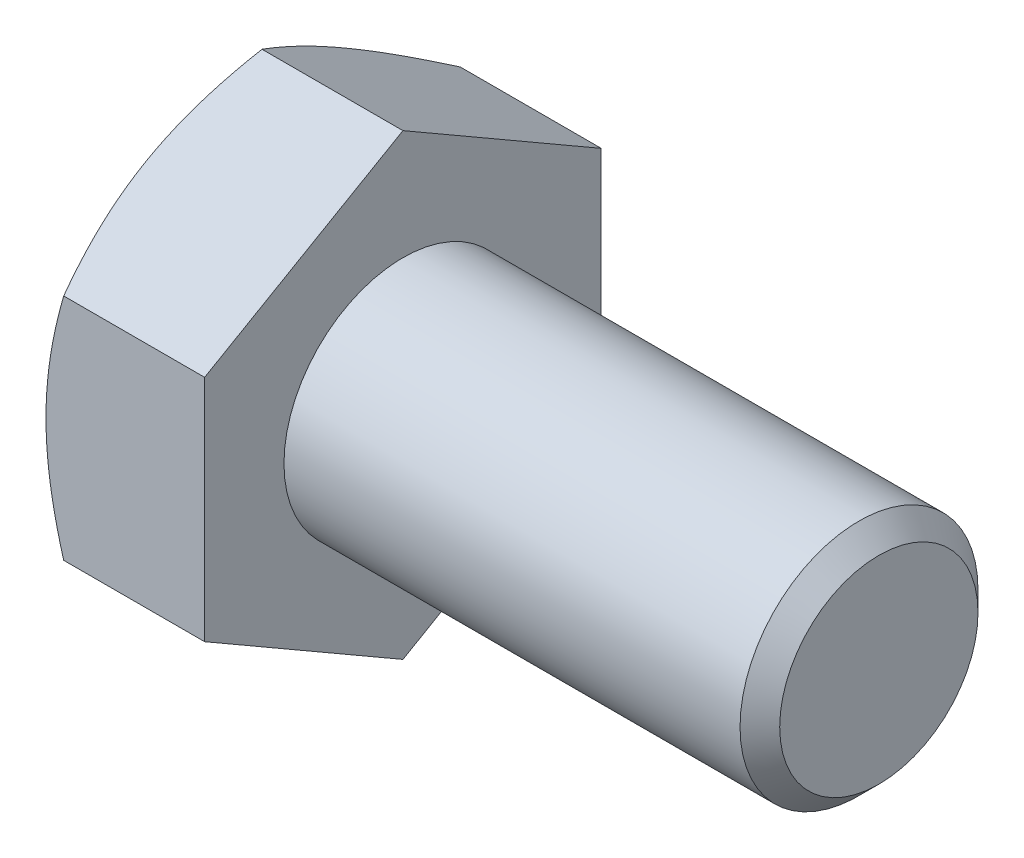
ISO-10303-21;
HEADER;
FILE_DESCRIPTION(('STEP AP214'),'2;1');
FILE_NAME('part.step','',(''),(''),'','','');
FILE_SCHEMA(('AUTOMOTIVE_DESIGN { 1 0 10303 214 1 1 1 1 }'));
ENDSEC;
DATA;
#1=APPLICATION_CONTEXT('core data for automotive mechanical design processes');
#2=APPLICATION_PROTOCOL_DEFINITION('international standard','automotive_design',2000,#1);
#3=PRODUCT_CONTEXT('',#1,'mechanical');
#4=PRODUCT('Part','Part','',(#3));
#5=PRODUCT_RELATED_PRODUCT_CATEGORY('part','',(#4));
#6=PRODUCT_DEFINITION_FORMATION('','',#4);
#7=PRODUCT_DEFINITION_CONTEXT('part definition',#1,'design');
#8=PRODUCT_DEFINITION('design','',#6,#7);
#9=PRODUCT_DEFINITION_SHAPE('','',#8);
#10=(LENGTH_UNIT() NAMED_UNIT(*) SI_UNIT(.MILLI.,.METRE.));
#11=(NAMED_UNIT(*) PLANE_ANGLE_UNIT() SI_UNIT($,.RADIAN.));
#12=(NAMED_UNIT(*) SI_UNIT($,.STERADIAN.) SOLID_ANGLE_UNIT());
#13=UNCERTAINTY_MEASURE_WITH_UNIT(LENGTH_MEASURE(1.E-05),#10,'distance_accuracy_value','');
#14=(GEOMETRIC_REPRESENTATION_CONTEXT(3) GLOBAL_UNCERTAINTY_ASSIGNED_CONTEXT((#13)) GLOBAL_UNIT_ASSIGNED_CONTEXT((#10,
#11,#12)) REPRESENTATION_CONTEXT('',''));
#15=CARTESIAN_POINT('',(0.,0.,0.));
#16=DIRECTION('',(0.,0.,1.));
#17=DIRECTION('',(1.,0.,0.));
#18=AXIS2_PLACEMENT_3D('',#15,#16,#17);
#19=CARTESIAN_POINT('',(12.,0.,0.));
#20=DIRECTION('',(-1.,0.,0.));
#21=DIRECTION('',(0.,0.,1.));
#22=AXIS2_PLACEMENT_3D('',#19,#20,#21);
#23=CYLINDRICAL_SURFACE('',#22,3.);
#24=CARTESIAN_POINT('',(11.5,0.,0.));
#25=DIRECTION('',(1.,0.,0.));
#26=DIRECTION('',(0.,0.,-1.));
#27=AXIS2_PLACEMENT_3D('',#24,#25,#26);
#28=CIRCLE('',#27,3.);
#29=CARTESIAN_POINT('',(11.5,0.,-3.));
#30=VERTEX_POINT('',#29);
#31=EDGE_CURVE('E11',#30,#30,#28,.F.);
#32=ORIENTED_EDGE('',*,*,#31,.T.);
#33=EDGE_LOOP('',(#32));
#34=FACE_BOUND('',#33,.T.);
#35=CARTESIAN_POINT('',(0.,0.,0.));
#36=DIRECTION('',(-1.,0.,0.));
#37=DIRECTION('',(0.,0.,1.));
#38=AXIS2_PLACEMENT_3D('',#35,#36,#37);
#39=CIRCLE('',#38,3.);
#40=CARTESIAN_POINT('',(0.,0.,3.));
#41=VERTEX_POINT('',#40);
#42=EDGE_CURVE('E206',#41,#41,#39,.T.);
#43=ORIENTED_EDGE('',*,*,#42,.F.);
#44=EDGE_LOOP('',(#43));
#45=FACE_BOUND('',#44,.T.);
#46=ADVANCED_FACE('F32',(#34,#45),#23,.T.);
#47=CARTESIAN_POINT('',(12.,0.,0.));
#48=DIRECTION('',(1.,0.,0.));
#49=DIRECTION('',(0.,0.,-1.));
#50=AXIS2_PLACEMENT_3D('',#47,#48,#49);
#51=PLANE('',#50);
#52=CARTESIAN_POINT('',(12.,0.,0.));
#53=DIRECTION('',(1.,0.,0.));
#54=DIRECTION('',(0.,0.,-1.));
#55=AXIS2_PLACEMENT_3D('',#52,#53,#54);
#56=CIRCLE('',#55,2.49999999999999);
#57=CARTESIAN_POINT('',(12.,0.,-2.49999999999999));
#58=VERTEX_POINT('',#57);
#59=EDGE_CURVE('E39',#58,#58,#56,.T.);
#60=ORIENTED_EDGE('',*,*,#59,.T.);
#61=EDGE_LOOP('',(#60));
#62=FACE_BOUND('',#61,.T.);
#63=ADVANCED_FACE('F192',(#62),#51,.T.);
#64=CARTESIAN_POINT('',(0.,-2.88675134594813,5.));
#65=DIRECTION('',(-1.,0.,0.));
#66=DIRECTION('',(0.,0.,1.));
#67=AXIS2_PLACEMENT_3D('',#64,#65,#66);
#68=PLANE('',#67);
#69=DIRECTION('',(0.,0.5,0.866025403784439));
#70=VECTOR('',#69,1.);
#71=CARTESIAN_POINT('',(0.,-5.77350269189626,0.));
#72=LINE('',#71,#70);
#73=CARTESIAN_POINT('',(0.,-5.77350269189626,0.));
#74=VERTEX_POINT('',#73);
#75=CARTESIAN_POINT('',(0.,-2.88675134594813,5.));
#76=VERTEX_POINT('',#75);
#77=EDGE_CURVE('E233',#74,#76,#72,.T.);
#78=ORIENTED_EDGE('',*,*,#77,.F.);
#79=DIRECTION('',(0.,0.5,-0.866025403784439));
#80=VECTOR('',#79,1.);
#81=CARTESIAN_POINT('',(0.,-5.77350269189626,0.));
#82=LINE('',#81,#80);
#83=CARTESIAN_POINT('',(0.,-2.88675134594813,-5.));
#84=VERTEX_POINT('',#83);
#85=EDGE_CURVE('E220',#74,#84,#82,.T.);
#86=ORIENTED_EDGE('',*,*,#85,.T.);
#87=DIRECTION('',(0.,1.,0.));
#88=VECTOR('',#87,1.);
#89=CARTESIAN_POINT('',(0.,-2.88675134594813,-5.));
#90=LINE('',#89,#88);
#91=CARTESIAN_POINT('',(0.,2.88675134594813,-5.));
#92=VERTEX_POINT('',#91);
#93=EDGE_CURVE('E223',#84,#92,#90,.T.);
#94=ORIENTED_EDGE('',*,*,#93,.T.);
#95=DIRECTION('',(0.,0.5,0.866025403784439));
#96=VECTOR('',#95,1.);
#97=CARTESIAN_POINT('',(0.,2.88675134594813,-5.));
#98=LINE('',#97,#96);
#99=CARTESIAN_POINT('',(0.,5.77350269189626,0.));
#100=VERTEX_POINT('',#99);
#101=EDGE_CURVE('E226',#92,#100,#98,.T.);
#102=ORIENTED_EDGE('',*,*,#101,.T.);
#103=DIRECTION('',(0.,0.5,-0.866025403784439));
#104=VECTOR('',#103,1.);
#105=CARTESIAN_POINT('',(0.,2.88675134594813,5.));
#106=LINE('',#105,#104);
#107=CARTESIAN_POINT('',(0.,2.88675134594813,5.));
#108=VERTEX_POINT('',#107);
#109=EDGE_CURVE('E229',#108,#100,#106,.T.);
#110=ORIENTED_EDGE('',*,*,#109,.F.);
#111=DIRECTION('',(0.,1.,0.));
#112=VECTOR('',#111,1.);
#113=CARTESIAN_POINT('',(0.,-2.88675134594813,5.));
#114=LINE('',#113,#112);
#115=EDGE_CURVE('E231',#76,#108,#114,.T.);
#116=ORIENTED_EDGE('',*,*,#115,.F.);
#117=EDGE_LOOP('',(#78,#86,#94,#102,#110,#116));
#118=FACE_BOUND('',#117,.T.);
#119=ORIENTED_EDGE('',*,*,#42,.T.);
#120=EDGE_LOOP('',(#119));
#121=FACE_BOUND('',#120,.T.);
#122=ADVANCED_FACE('F163',(#118,#121),#68,.F.);
#123=CARTESIAN_POINT('',(-4.,-5.77350269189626,0.));
#124=DIRECTION('',(0.,0.866025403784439,-0.5));
#125=DIRECTION('',(0.,0.5,0.866025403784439));
#126=AXIS2_PLACEMENT_3D('',#123,#124,#125);
#127=PLANE('',#126);
#128=CARTESIAN_POINT('',(-3.55335134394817,-5.7736181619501,-0.000200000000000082));
#129=CARTESIAN_POINT('',(-3.62661343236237,-5.64675433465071,0.219534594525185));
#130=CARTESIAN_POINT('',(-3.69324867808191,-5.5188054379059,0.44114858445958));
#131=CARTESIAN_POINT('',(-3.80956100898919,-5.26069210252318,0.888213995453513));
#132=CARTESIAN_POINT('',(-3.85919695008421,-5.13052307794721,1.11367335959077));
#133=CARTESIAN_POINT('',(-3.9364489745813,-4.87177839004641,1.56183230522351));
#134=CARTESIAN_POINT('',(-3.96457962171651,-4.74324302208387,1.78446209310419));
#135=CARTESIAN_POINT('',(-3.98980507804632,-4.54998783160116,2.11918990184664));
#136=CARTESIAN_POINT('',(-3.99538654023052,-4.48552534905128,2.23084219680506));
#137=CARTESIAN_POINT('',(-4.00079778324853,-4.35654081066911,2.4542499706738));
#138=CARTESIAN_POINT('',(-4.0006277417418,-4.2920187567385,2.56600544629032));
#139=CARTESIAN_POINT('',(-3.99224636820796,-4.11524635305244,2.87218423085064));
#140=CARTESIAN_POINT('',(-3.97817022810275,-4.00305457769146,3.06650608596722));
#141=CARTESIAN_POINT('',(-3.93353474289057,-3.77941563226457,3.45386010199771));
#142=CARTESIAN_POINT('',(-3.90296013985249,-3.66796924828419,3.64689090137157));
#143=CARTESIAN_POINT('',(-3.82653150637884,-3.44387972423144,4.03502534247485));
#144=CARTESIAN_POINT('',(-3.78035362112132,-3.3312648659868,4.23007999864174));
#145=CARTESIAN_POINT('',(-3.67554820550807,-3.10771464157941,4.61728034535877));
#146=CARTESIAN_POINT('',(-3.61694529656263,-2.99677641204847,4.80943099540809));
#147=CARTESIAN_POINT('',(-3.55335134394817,-2.88663587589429,5.0002));
#148=B_SPLINE_CURVE_WITH_KNOTS('',3,(#128,#129,#130,#131,#132,#133,#134,#135,#136,#137,#138,
#139,#140,#141,#142,#143,#144,#145,#146,#147),.UNSPECIFIED.,.F.,.F.,(4,2,2,2,2,2,2,2,2,4),(0.,
0.79255584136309,1.58701660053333,2.36181537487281,2.74884076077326,3.13585419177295,
3.80962362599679,4.48401723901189,5.17336882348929,5.86136694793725),.UNSPECIFIED.);
#149=CARTESIAN_POINT('',(-3.5534180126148,-5.77350269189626,0.));
#150=VERTEX_POINT('',#149);
#151=CARTESIAN_POINT('',(-4.,-4.3301270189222,2.5));
#152=VERTEX_POINT('',#151);
#153=EDGE_CURVE('E180',#150,#152,#148,.T.);
#154=ORIENTED_EDGE('',*,*,#153,.F.);
#155=DIRECTION('',(1.,0.,0.));
#156=VECTOR('',#155,1.);
#157=CARTESIAN_POINT('',(-4.,-5.77350269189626,0.));
#158=LINE('',#157,#156);
#159=EDGE_CURVE('E218',#150,#74,#158,.T.);
#160=ORIENTED_EDGE('',*,*,#159,.T.);
#161=ORIENTED_EDGE('',*,*,#77,.T.);
#162=DIRECTION('',(1.,0.,0.));
#163=VECTOR('',#162,1.);
#164=CARTESIAN_POINT('',(-4.,-2.88675134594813,5.));
#165=LINE('',#164,#163);
#166=CARTESIAN_POINT('',(-3.5534180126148,-2.88675134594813,5.));
#167=VERTEX_POINT('',#166);
#168=EDGE_CURVE('E209',#167,#76,#165,.T.);
#169=ORIENTED_EDGE('',*,*,#168,.F.);
#170=EDGE_CURVE('E134',#152,#167,#148,.T.);
#171=ORIENTED_EDGE('',*,*,#170,.F.);
#172=EDGE_LOOP('',(#154,#160,#161,#169,#171));
#173=FACE_BOUND('',#172,.T.);
#174=ADVANCED_FACE('F186',(#173),#127,.F.);
#175=CARTESIAN_POINT('',(-4.,-2.88675134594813,5.));
#176=DIRECTION('',(0.,0.,-1.));
#177=DIRECTION('',(-1.,0.,0.));
#178=AXIS2_PLACEMENT_3D('',#175,#176,#177);
#179=PLANE('',#178);
#180=CARTESIAN_POINT('',(-1.50175754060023,-7.8736570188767,5.));
#181=CARTESIAN_POINT('',(-1.6086809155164,-7.65421637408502,5.));
#182=CARTESIAN_POINT('',(-1.71461296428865,-7.43428458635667,5.));
#183=CARTESIAN_POINT('',(-1.92393906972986,-6.99317792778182,5.));
#184=CARTESIAN_POINT('',(-2.02733274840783,-6.77200287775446,5.));
#185=CARTESIAN_POINT('',(-2.23152152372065,-6.32706593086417,5.));
#186=CARTESIAN_POINT('',(-2.33230041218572,-6.10329657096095,5.));
#187=CARTESIAN_POINT('',(-2.52988978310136,-5.65401907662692,5.));
#188=CARTESIAN_POINT('',(-2.62670044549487,-5.42851102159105,5.));
#189=CARTESIAN_POINT('',(-2.81850105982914,-4.96773019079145,5.));
#190=CARTESIAN_POINT('',(-2.91331851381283,-4.73238523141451,5.));
#191=CARTESIAN_POINT('',(-3.09606229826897,-4.25898650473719,5.));
#192=CARTESIAN_POINT('',(-3.18398787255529,-4.02093244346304,5.));
#193=CARTESIAN_POINT('',(-3.35072723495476,-3.54214478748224,5.));
#194=CARTESIAN_POINT('',(-3.42955846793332,-3.30141732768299,5.));
#195=CARTESIAN_POINT('',(-3.57565910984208,-2.81651125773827,5.));
#196=CARTESIAN_POINT('',(-3.64293203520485,-2.5723337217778,5.));
#197=CARTESIAN_POINT('',(-3.7624103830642,-2.08173956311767,5.));
#198=CARTESIAN_POINT('',(-3.81470009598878,-1.83534384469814,5.));
#199=CARTESIAN_POINT('',(-3.90133365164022,-1.33936717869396,5.));
#200=CARTESIAN_POINT('',(-3.93567944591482,-1.08978658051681,5.));
#201=CARTESIAN_POINT('',(-3.98324171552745,-0.59199465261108,5.));
#202=CARTESIAN_POINT('',(-3.99673913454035,-0.343810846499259,5.));
#203=CARTESIAN_POINT('',(-4.00220795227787,0.152820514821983,5.));
#204=CARTESIAN_POINT('',(-3.99417903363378,0.401268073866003,5.));
#205=CARTESIAN_POINT('',(-3.96311999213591,0.819539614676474,5.));
#206=CARTESIAN_POINT('',(-3.94552930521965,0.989794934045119,5.));
#207=CARTESIAN_POINT('',(-3.90127081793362,1.32912938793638,5.));
#208=CARTESIAN_POINT('',(-3.87460188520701,1.4982083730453,5.));
#209=CARTESIAN_POINT('',(-3.78237229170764,2.00341173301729,5.));
#210=CARTESIAN_POINT('',(-3.7046029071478,2.337335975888,5.));
#211=CARTESIAN_POINT('',(-3.56883106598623,2.83691487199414,5.));
#212=CARTESIAN_POINT('',(-3.51971360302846,3.00513229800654,5.));
#213=CARTESIAN_POINT('',(-3.41615110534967,3.33993504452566,5.));
#214=CARTESIAN_POINT('',(-3.36170602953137,3.5065203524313,5.));
#215=CARTESIAN_POINT('',(-3.24838071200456,3.83810926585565,5.));
#216=CARTESIAN_POINT('',(-3.18950171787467,4.00311330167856,5.));
#217=CARTESIAN_POINT('',(-3.0680238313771,4.33173746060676,5.));
#218=CARTESIAN_POINT('',(-3.00542502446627,4.49535761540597,5.));
#219=CARTESIAN_POINT('',(-2.83201950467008,4.93598294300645,5.));
#220=CARTESIAN_POINT('',(-2.71826266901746,5.21182602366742,5.));
#221=CARTESIAN_POINT('',(-2.48405585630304,5.76066658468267,5.));
#222=CARTESIAN_POINT('',(-2.36360513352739,6.03366374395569,5.));
#223=CARTESIAN_POINT('',(-2.11759609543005,6.57746623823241,5.));
#224=CARTESIAN_POINT('',(-1.99203582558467,6.84827068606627,5.));
#225=CARTESIAN_POINT('',(-1.73703058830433,7.38802449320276,5.));
#226=CARTESIAN_POINT('',(-1.60758577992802,7.65697392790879,5.));
#227=CARTESIAN_POINT('',(-1.34544789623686,8.19381940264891,5.));
#228=CARTESIAN_POINT('',(-1.21274991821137,8.46171304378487,5.));
#229=CARTESIAN_POINT('',(-0.944933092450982,8.99628800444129,5.));
#230=CARTESIAN_POINT('',(-0.809814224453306,9.26296931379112,5.));
#231=CARTESIAN_POINT('',(-0.401627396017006,10.0614145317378,5.));
#232=CARTESIAN_POINT('',(-0.125669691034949,10.5917004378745,5.));
#233=CARTESIAN_POINT('',(0.401869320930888,11.5934978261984,5.));
#234=CARTESIAN_POINT('',(0.652934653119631,12.0652823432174,5.));
#235=CARTESIAN_POINT('',(1.15809174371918,13.0072652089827,5.));
#236=CARTESIAN_POINT('',(1.41218368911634,13.4774634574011,5.));
#237=CARTESIAN_POINT('',(1.92174727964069,14.4150598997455,5.));
#238=CARTESIAN_POINT('',(2.17721139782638,14.8824621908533,5.));
#239=CARTESIAN_POINT('',(2.68985606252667,15.8162766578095,5.));
#240=CARTESIAN_POINT('',(2.94703647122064,16.2826889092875,5.));
#241=CARTESIAN_POINT('',(3.20484156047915,16.7487534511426,5.));
#242=B_SPLINE_CURVE_WITH_KNOTS('',3,(#180,#181,#182,#183,#184,#185,#186,#187,#188,#189,#190,
#191,#192,#193,#194,#195,#196,#197,#198,#199,#200,#201,#202,#203,#204,#205,#206,#207,#208,#209,
#210,#211,#212,#213,#214,#215,#216,#217,#218,#219,#220,#221,#222,#223,#224,#225,#226,#227,#228,
#229,#230,#231,#232,#233,#234,#235,#236,#237,#238,#239,#240,#241),.UNSPECIFIED.,.F.,.F.,(4,2,2,
2,2,2,2,2,2,2,2,2,2,2,2,2,2,2,2,2,2,2,2,2,2,2,2,2,2,2,4),(0.,0.732320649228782,1.46474969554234,
2.20096737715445,2.93715163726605,3.69825037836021,4.45943251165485,5.21912936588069,
5.97859468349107,6.73369963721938,7.48872245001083,8.23347928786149,8.97824710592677,
9.49148539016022,10.0047877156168,11.0318914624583,11.5575684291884,12.0832494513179,
12.6087831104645,13.1343047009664,14.0293094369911,14.9244140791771,15.819864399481,
16.7152781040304,17.612136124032,18.5090016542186,20.3023290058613,21.9056050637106,
23.5089806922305,25.106957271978,26.7048070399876),.UNSPECIFIED.);
#243=CARTESIAN_POINT('',(-4.,0.,5.));
#244=VERTEX_POINT('',#243);
#245=EDGE_CURVE('E235',#167,#244,#242,.T.);
#246=ORIENTED_EDGE('',*,*,#245,.F.);
#247=ORIENTED_EDGE('',*,*,#168,.T.);
#248=ORIENTED_EDGE('',*,*,#115,.T.);
#249=DIRECTION('',(1.,0.,0.));
#250=VECTOR('',#249,1.);
#251=CARTESIAN_POINT('',(-4.,2.88675134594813,5.));
#252=LINE('',#251,#250);
#253=CARTESIAN_POINT('',(-3.5534180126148,2.88675134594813,5.));
#254=VERTEX_POINT('',#253);
#255=EDGE_CURVE('E211',#254,#108,#252,.T.);
#256=ORIENTED_EDGE('',*,*,#255,.F.);
#257=EDGE_CURVE('E105',#244,#254,#242,.T.);
#258=ORIENTED_EDGE('',*,*,#257,.F.);
#259=EDGE_LOOP('',(#246,#247,#248,#256,#258));
#260=FACE_BOUND('',#259,.T.);
#261=ADVANCED_FACE('F189',(#260),#179,.F.);
#262=CARTESIAN_POINT('',(-4.,2.88675134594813,5.));
#263=DIRECTION('',(0.,-0.866025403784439,-0.5));
#264=DIRECTION('',(0.,0.5,-0.866025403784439));
#265=AXIS2_PLACEMENT_3D('',#262,#263,#264);
#266=PLANE('',#265);
#267=CARTESIAN_POINT('',(-3.55335134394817,2.88663587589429,5.0002));
#268=CARTESIAN_POINT('',(-3.62661343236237,3.01349970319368,4.78046540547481));
#269=CARTESIAN_POINT('',(-3.69324867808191,3.14144859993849,4.55885141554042));
#270=CARTESIAN_POINT('',(-3.80956100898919,3.39956193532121,4.11178600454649));
#271=CARTESIAN_POINT('',(-3.85919695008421,3.52973095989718,3.88632664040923));
#272=CARTESIAN_POINT('',(-3.9364489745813,3.78847564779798,3.43816769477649));
#273=CARTESIAN_POINT('',(-3.96457962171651,3.91701101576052,3.21553790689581));
#274=CARTESIAN_POINT('',(-3.98980507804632,4.11026620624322,2.88081009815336));
#275=CARTESIAN_POINT('',(-3.99538654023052,4.17472868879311,2.76915780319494));
#276=CARTESIAN_POINT('',(-4.00079778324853,4.30371322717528,2.5457500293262));
#277=CARTESIAN_POINT('',(-4.0006277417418,4.36823528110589,2.43399455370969));
#278=CARTESIAN_POINT('',(-3.99224636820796,4.54500768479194,2.12781576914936));
#279=CARTESIAN_POINT('',(-3.97817022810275,4.65719946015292,1.93349391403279));
#280=CARTESIAN_POINT('',(-3.93353474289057,4.88083840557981,1.54613989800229));
#281=CARTESIAN_POINT('',(-3.90296013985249,4.9922847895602,1.35310909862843));
#282=CARTESIAN_POINT('',(-3.82653150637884,5.21637431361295,0.964974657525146));
#283=CARTESIAN_POINT('',(-3.78035362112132,5.32898917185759,0.769920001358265));
#284=CARTESIAN_POINT('',(-3.67554820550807,5.55253939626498,0.382719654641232));
#285=CARTESIAN_POINT('',(-3.61694529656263,5.66347762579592,0.190569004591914));
#286=CARTESIAN_POINT('',(-3.55335134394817,5.7736181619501,-0.000199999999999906));
#287=B_SPLINE_CURVE_WITH_KNOTS('',3,(#267,#268,#269,#270,#271,#272,#273,#274,#275,#276,#277,
#278,#279,#280,#281,#282,#283,#284,#285,#286),.UNSPECIFIED.,.F.,.F.,(4,2,2,2,2,2,2,2,2,4),(0.,
0.792555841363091,1.58701660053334,2.36181537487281,2.74884076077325,3.13585419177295,
3.80962362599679,4.48401723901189,5.17336882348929,5.86136694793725),.UNSPECIFIED.);
#288=CARTESIAN_POINT('',(-4.,4.33012701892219,2.5));
#289=VERTEX_POINT('',#288);
#290=EDGE_CURVE('E101',#254,#289,#287,.T.);
#291=ORIENTED_EDGE('',*,*,#290,.F.);
#292=ORIENTED_EDGE('',*,*,#255,.T.);
#293=ORIENTED_EDGE('',*,*,#109,.T.);
#294=DIRECTION('',(1.,0.,0.));
#295=VECTOR('',#294,1.);
#296=CARTESIAN_POINT('',(-4.,5.77350269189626,0.));
#297=LINE('',#296,#295);
#298=CARTESIAN_POINT('',(-3.5534180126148,5.77350269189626,0.));
#299=VERTEX_POINT('',#298);
#300=EDGE_CURVE('E133',#299,#100,#297,.T.);
#301=ORIENTED_EDGE('',*,*,#300,.F.);
#302=EDGE_CURVE('E109',#289,#299,#287,.T.);
#303=ORIENTED_EDGE('',*,*,#302,.F.);
#304=EDGE_LOOP('',(#291,#292,#293,#301,#303));
#305=FACE_BOUND('',#304,.T.);
#306=ADVANCED_FACE('F131',(#305),#266,.F.);
#307=CARTESIAN_POINT('',(-4.,2.88675134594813,-5.));
#308=DIRECTION('',(0.,0.866025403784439,-0.5));
#309=DIRECTION('',(0.,0.5,0.866025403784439));
#310=AXIS2_PLACEMENT_3D('',#307,#308,#309);
#311=PLANE('',#310);
#312=DIRECTION('',(1.,0.,0.));
#313=VECTOR('',#312,1.);
#314=CARTESIAN_POINT('',(-4.,2.88675134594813,-5.));
#315=LINE('',#314,#313);
#316=CARTESIAN_POINT('',(-3.5534180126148,2.88675134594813,-5.));
#317=VERTEX_POINT('',#316);
#318=EDGE_CURVE('E214',#317,#92,#315,.T.);
#319=ORIENTED_EDGE('',*,*,#318,.F.);
#320=CARTESIAN_POINT('',(-3.55335134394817,2.88663587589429,-5.0002));
#321=CARTESIAN_POINT('',(-3.62661343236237,3.01349970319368,-4.78046540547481));
#322=CARTESIAN_POINT('',(-3.69324867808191,3.14144859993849,-4.55885141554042));
#323=CARTESIAN_POINT('',(-3.80956100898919,3.39956193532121,-4.11178600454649));
#324=CARTESIAN_POINT('',(-3.85919695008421,3.52973095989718,-3.88632664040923));
#325=CARTESIAN_POINT('',(-3.9364489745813,3.78847564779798,-3.43816769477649));
#326=CARTESIAN_POINT('',(-3.96457962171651,3.91701101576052,-3.21553790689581));
#327=CARTESIAN_POINT('',(-3.98980507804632,4.11026620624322,-2.88081009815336));
#328=CARTESIAN_POINT('',(-3.99538654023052,4.17472868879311,-2.76915780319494));
#329=CARTESIAN_POINT('',(-4.00079778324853,4.30371322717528,-2.5457500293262));
#330=CARTESIAN_POINT('',(-4.0006277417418,4.36823528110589,-2.43399455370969));
#331=CARTESIAN_POINT('',(-3.99224636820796,4.54500768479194,-2.12781576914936));
#332=CARTESIAN_POINT('',(-3.97817022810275,4.65719946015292,-1.93349391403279));
#333=CARTESIAN_POINT('',(-3.93353474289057,4.88083840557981,-1.54613989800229));
#334=CARTESIAN_POINT('',(-3.90296013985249,4.9922847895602,-1.35310909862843));
#335=CARTESIAN_POINT('',(-3.82653150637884,5.21637431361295,-0.964974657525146));
#336=CARTESIAN_POINT('',(-3.78035362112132,5.32898917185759,-0.769920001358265));
#337=CARTESIAN_POINT('',(-3.67554820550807,5.55253939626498,-0.382719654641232));
#338=CARTESIAN_POINT('',(-3.61694529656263,5.66347762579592,-0.190569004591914));
#339=CARTESIAN_POINT('',(-3.55335134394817,5.7736181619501,0.000199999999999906));
#340=B_SPLINE_CURVE_WITH_KNOTS('',3,(#320,#321,#322,#323,#324,#325,#326,#327,#328,#329,#330,
#331,#332,#333,#334,#335,#336,#337,#338,#339),.UNSPECIFIED.,.F.,.F.,(4,2,2,2,2,2,2,2,2,4),(0.,
0.792555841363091,1.58701660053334,2.36181537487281,2.74884076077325,3.13585419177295,
3.80962362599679,4.48401723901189,5.17336882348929,5.86136694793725),.UNSPECIFIED.);
#341=CARTESIAN_POINT('',(-4.,4.33012701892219,-2.5));
#342=VERTEX_POINT('',#341);
#343=EDGE_CURVE('E136',#317,#342,#340,.T.);
#344=ORIENTED_EDGE('',*,*,#343,.T.);
#345=EDGE_CURVE('E116',#342,#299,#340,.T.);
#346=ORIENTED_EDGE('',*,*,#345,.T.);
#347=ORIENTED_EDGE('',*,*,#300,.T.);
#348=ORIENTED_EDGE('',*,*,#101,.F.);
#349=EDGE_LOOP('',(#319,#344,#346,#347,#348));
#350=FACE_BOUND('',#349,.T.);
#351=ADVANCED_FACE('F261',(#350),#311,.T.);
#352=CARTESIAN_POINT('',(-4.,-2.88675134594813,-5.));
#353=DIRECTION('',(0.,0.,-1.));
#354=DIRECTION('',(-1.,0.,0.));
#355=AXIS2_PLACEMENT_3D('',#352,#353,#354);
#356=PLANE('',#355);
#357=DIRECTION('',(1.,0.,0.));
#358=VECTOR('',#357,1.);
#359=CARTESIAN_POINT('',(-4.,-2.88675134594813,-5.));
#360=LINE('',#359,#358);
#361=CARTESIAN_POINT('',(-3.5534180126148,-2.88675134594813,-5.));
#362=VERTEX_POINT('',#361);
#363=EDGE_CURVE('E216',#362,#84,#360,.T.);
#364=ORIENTED_EDGE('',*,*,#363,.F.);
#365=CARTESIAN_POINT('',(-1.50175754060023,-7.8736570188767,-5.));
#366=CARTESIAN_POINT('',(-1.6086809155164,-7.65421637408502,-5.));
#367=CARTESIAN_POINT('',(-1.71461296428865,-7.43428458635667,-5.));
#368=CARTESIAN_POINT('',(-1.92393906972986,-6.99317792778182,-5.));
#369=CARTESIAN_POINT('',(-2.02733274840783,-6.77200287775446,-5.));
#370=CARTESIAN_POINT('',(-2.23152152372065,-6.32706593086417,-5.));
#371=CARTESIAN_POINT('',(-2.33230041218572,-6.10329657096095,-5.));
#372=CARTESIAN_POINT('',(-2.52988978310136,-5.65401907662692,-5.));
#373=CARTESIAN_POINT('',(-2.62670044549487,-5.42851102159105,-5.));
#374=CARTESIAN_POINT('',(-2.81850105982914,-4.96773019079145,-5.));
#375=CARTESIAN_POINT('',(-2.91331851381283,-4.73238523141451,-5.));
#376=CARTESIAN_POINT('',(-3.09606229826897,-4.25898650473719,-5.));
#377=CARTESIAN_POINT('',(-3.18398787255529,-4.02093244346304,-5.));
#378=CARTESIAN_POINT('',(-3.35072723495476,-3.54214478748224,-5.));
#379=CARTESIAN_POINT('',(-3.42955846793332,-3.30141732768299,-5.));
#380=CARTESIAN_POINT('',(-3.57565910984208,-2.81651125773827,-5.));
#381=CARTESIAN_POINT('',(-3.64293203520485,-2.5723337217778,-5.));
#382=CARTESIAN_POINT('',(-3.7624103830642,-2.08173956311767,-5.));
#383=CARTESIAN_POINT('',(-3.81470009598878,-1.83534384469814,-5.));
#384=CARTESIAN_POINT('',(-3.90133365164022,-1.33936717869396,-5.));
#385=CARTESIAN_POINT('',(-3.93567944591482,-1.08978658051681,-5.));
#386=CARTESIAN_POINT('',(-3.98324171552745,-0.59199465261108,-5.));
#387=CARTESIAN_POINT('',(-3.99673913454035,-0.343810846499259,-5.));
#388=CARTESIAN_POINT('',(-4.00220795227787,0.152820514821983,-5.));
#389=CARTESIAN_POINT('',(-3.99417903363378,0.401268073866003,-5.));
#390=CARTESIAN_POINT('',(-3.96311999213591,0.819539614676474,-5.));
#391=CARTESIAN_POINT('',(-3.94552930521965,0.989794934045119,-5.));
#392=CARTESIAN_POINT('',(-3.90127081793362,1.32912938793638,-5.));
#393=CARTESIAN_POINT('',(-3.87460188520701,1.4982083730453,-5.));
#394=CARTESIAN_POINT('',(-3.78237229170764,2.00341173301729,-5.));
#395=CARTESIAN_POINT('',(-3.7046029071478,2.337335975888,-5.));
#396=CARTESIAN_POINT('',(-3.56883106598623,2.83691487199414,-5.));
#397=CARTESIAN_POINT('',(-3.51971360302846,3.00513229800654,-5.));
#398=CARTESIAN_POINT('',(-3.41615110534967,3.33993504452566,-5.));
#399=CARTESIAN_POINT('',(-3.36170602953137,3.5065203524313,-5.));
#400=CARTESIAN_POINT('',(-3.24838071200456,3.83810926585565,-5.));
#401=CARTESIAN_POINT('',(-3.18950171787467,4.00311330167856,-5.));
#402=CARTESIAN_POINT('',(-3.0680238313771,4.33173746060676,-5.));
#403=CARTESIAN_POINT('',(-3.00542502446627,4.49535761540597,-5.));
#404=CARTESIAN_POINT('',(-2.83201950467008,4.93598294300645,-5.));
#405=CARTESIAN_POINT('',(-2.71826266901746,5.21182602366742,-5.));
#406=CARTESIAN_POINT('',(-2.48405585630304,5.76066658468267,-5.));
#407=CARTESIAN_POINT('',(-2.36360513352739,6.03366374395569,-5.));
#408=CARTESIAN_POINT('',(-2.11759609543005,6.57746623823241,-5.));
#409=CARTESIAN_POINT('',(-1.99203582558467,6.84827068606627,-5.));
#410=CARTESIAN_POINT('',(-1.73703058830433,7.38802449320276,-5.));
#411=CARTESIAN_POINT('',(-1.60758577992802,7.65697392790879,-5.));
#412=CARTESIAN_POINT('',(-1.34544789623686,8.19381940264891,-5.));
#413=CARTESIAN_POINT('',(-1.21274991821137,8.46171304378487,-5.));
#414=CARTESIAN_POINT('',(-0.944933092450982,8.99628800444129,-5.));
#415=CARTESIAN_POINT('',(-0.809814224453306,9.26296931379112,-5.));
#416=CARTESIAN_POINT('',(-0.401627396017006,10.0614145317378,-5.));
#417=CARTESIAN_POINT('',(-0.125669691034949,10.5917004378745,-5.));
#418=CARTESIAN_POINT('',(0.401869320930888,11.5934978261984,-5.));
#419=CARTESIAN_POINT('',(0.652934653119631,12.0652823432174,-5.));
#420=CARTESIAN_POINT('',(1.15809174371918,13.0072652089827,-5.));
#421=CARTESIAN_POINT('',(1.41218368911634,13.4774634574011,-5.));
#422=CARTESIAN_POINT('',(1.92174727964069,14.4150598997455,-5.));
#423=CARTESIAN_POINT('',(2.17721139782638,14.8824621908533,-5.));
#424=CARTESIAN_POINT('',(2.68985606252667,15.8162766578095,-5.));
#425=CARTESIAN_POINT('',(2.94703647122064,16.2826889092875,-5.));
#426=CARTESIAN_POINT('',(3.20484156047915,16.7487534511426,-5.));
#427=B_SPLINE_CURVE_WITH_KNOTS('',3,(#365,#366,#367,#368,#369,#370,#371,#372,#373,#374,#375,
#376,#377,#378,#379,#380,#381,#382,#383,#384,#385,#386,#387,#388,#389,#390,#391,#392,#393,#394,
#395,#396,#397,#398,#399,#400,#401,#402,#403,#404,#405,#406,#407,#408,#409,#410,#411,#412,#413,
#414,#415,#416,#417,#418,#419,#420,#421,#422,#423,#424,#425,#426),.UNSPECIFIED.,.F.,.F.,(4,2,2,
2,2,2,2,2,2,2,2,2,2,2,2,2,2,2,2,2,2,2,2,2,2,2,2,2,2,2,4),(0.,0.732320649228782,1.46474969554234,
2.20096737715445,2.93715163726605,3.69825037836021,4.45943251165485,5.21912936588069,
5.97859468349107,6.73369963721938,7.48872245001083,8.23347928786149,8.97824710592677,
9.49148539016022,10.0047877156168,11.0318914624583,11.5575684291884,12.0832494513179,
12.6087831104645,13.1343047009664,14.0293094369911,14.9244140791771,15.819864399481,
16.7152781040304,17.612136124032,18.5090016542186,20.3023290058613,21.9056050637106,
23.5089806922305,25.106957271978,26.7048070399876),.UNSPECIFIED.);
#428=CARTESIAN_POINT('',(-4.,0.,-5.));
#429=VERTEX_POINT('',#428);
#430=EDGE_CURVE('E54',#362,#429,#427,.T.);
#431=ORIENTED_EDGE('',*,*,#430,.T.);
#432=EDGE_CURVE('E185',#429,#317,#427,.T.);
#433=ORIENTED_EDGE('',*,*,#432,.T.);
#434=ORIENTED_EDGE('',*,*,#318,.T.);
#435=ORIENTED_EDGE('',*,*,#93,.F.);
#436=EDGE_LOOP('',(#364,#431,#433,#434,#435));
#437=FACE_BOUND('',#436,.T.);
#438=ADVANCED_FACE('F257',(#437),#356,.T.);
#439=CARTESIAN_POINT('',(-4.,-5.77350269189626,0.));
#440=DIRECTION('',(0.,-0.866025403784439,-0.5));
#441=DIRECTION('',(0.,0.5,-0.866025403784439));
#442=AXIS2_PLACEMENT_3D('',#439,#440,#441);
#443=PLANE('',#442);
#444=ORIENTED_EDGE('',*,*,#159,.F.);
#445=CARTESIAN_POINT('',(-3.55335134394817,-5.7736181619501,0.000200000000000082));
#446=CARTESIAN_POINT('',(-3.62661343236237,-5.64675433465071,-0.219534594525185));
#447=CARTESIAN_POINT('',(-3.69324867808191,-5.5188054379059,-0.44114858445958));
#448=CARTESIAN_POINT('',(-3.80956100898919,-5.26069210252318,-0.888213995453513));
#449=CARTESIAN_POINT('',(-3.85919695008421,-5.13052307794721,-1.11367335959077));
#450=CARTESIAN_POINT('',(-3.9364489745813,-4.87177839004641,-1.56183230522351));
#451=CARTESIAN_POINT('',(-3.96457962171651,-4.74324302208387,-1.78446209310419));
#452=CARTESIAN_POINT('',(-3.98980507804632,-4.54998783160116,-2.11918990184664));
#453=CARTESIAN_POINT('',(-3.99538654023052,-4.48552534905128,-2.23084219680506));
#454=CARTESIAN_POINT('',(-4.00079778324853,-4.35654081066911,-2.4542499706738));
#455=CARTESIAN_POINT('',(-4.0006277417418,-4.2920187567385,-2.56600544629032));
#456=CARTESIAN_POINT('',(-3.99224636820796,-4.11524635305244,-2.87218423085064));
#457=CARTESIAN_POINT('',(-3.97817022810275,-4.00305457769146,-3.06650608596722));
#458=CARTESIAN_POINT('',(-3.93353474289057,-3.77941563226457,-3.45386010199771));
#459=CARTESIAN_POINT('',(-3.90296013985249,-3.66796924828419,-3.64689090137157));
#460=CARTESIAN_POINT('',(-3.82653150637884,-3.44387972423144,-4.03502534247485));
#461=CARTESIAN_POINT('',(-3.78035362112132,-3.3312648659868,-4.23007999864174));
#462=CARTESIAN_POINT('',(-3.67554820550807,-3.10771464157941,-4.61728034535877));
#463=CARTESIAN_POINT('',(-3.61694529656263,-2.99677641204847,-4.80943099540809));
#464=CARTESIAN_POINT('',(-3.55335134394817,-2.88663587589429,-5.0002));
#465=B_SPLINE_CURVE_WITH_KNOTS('',3,(#445,#446,#447,#448,#449,#450,#451,#452,#453,#454,#455,
#456,#457,#458,#459,#460,#461,#462,#463,#464),.UNSPECIFIED.,.F.,.F.,(4,2,2,2,2,2,2,2,2,4),(0.,
0.79255584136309,1.58701660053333,2.36181537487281,2.74884076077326,3.13585419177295,
3.80962362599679,4.48401723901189,5.17336882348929,5.86136694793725),.UNSPECIFIED.);
#466=CARTESIAN_POINT('',(-4.,-4.3301270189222,-2.5));
#467=VERTEX_POINT('',#466);
#468=EDGE_CURVE('E249',#150,#467,#465,.T.);
#469=ORIENTED_EDGE('',*,*,#468,.T.);
#470=EDGE_CURVE('E128',#467,#362,#465,.T.);
#471=ORIENTED_EDGE('',*,*,#470,.T.);
#472=ORIENTED_EDGE('',*,*,#363,.T.);
#473=ORIENTED_EDGE('',*,*,#85,.F.);
#474=EDGE_LOOP('',(#444,#469,#471,#472,#473));
#475=FACE_BOUND('',#474,.T.);
#476=ADVANCED_FACE('F253',(#475),#443,.T.);
#477=CARTESIAN_POINT('',(-4.,0.,0.));
#478=DIRECTION('',(1.,0.,0.));
#479=DIRECTION('',(0.,0.,1.));
#480=AXIS2_PLACEMENT_3D('',#477,#478,#479);
#481=CONICAL_SURFACE('',#480,5.,1.0471975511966);
#482=ORIENTED_EDGE('',*,*,#170,.T.);
#483=ORIENTED_EDGE('',*,*,#245,.T.);
#484=CARTESIAN_POINT('',(-4.,0.,0.));
#485=DIRECTION('',(-1.,0.,0.));
#486=DIRECTION('',(0.,0.,1.));
#487=AXIS2_PLACEMENT_3D('',#484,#485,#486);
#488=CIRCLE('',#487,5.);
#489=EDGE_CURVE('E123',#152,#244,#488,.T.);
#490=ORIENTED_EDGE('',*,*,#489,.F.);
#491=EDGE_LOOP('',(#482,#483,#490));
#492=FACE_BOUND('',#491,.T.);
#493=ADVANCED_FACE('F161',(#492),#481,.T.);
#494=ORIENTED_EDGE('',*,*,#468,.F.);
#495=ORIENTED_EDGE('',*,*,#153,.T.);
#496=EDGE_CURVE('E205',#467,#152,#488,.T.);
#497=ORIENTED_EDGE('',*,*,#496,.F.);
#498=EDGE_LOOP('',(#494,#495,#497));
#499=FACE_BOUND('',#498,.T.);
#500=ADVANCED_FACE('F160',(#499),#481,.T.);
#501=ORIENTED_EDGE('',*,*,#430,.F.);
#502=ORIENTED_EDGE('',*,*,#470,.F.);
#503=EDGE_CURVE('E292',#429,#467,#488,.T.);
#504=ORIENTED_EDGE('',*,*,#503,.F.);
#505=EDGE_LOOP('',(#501,#502,#504));
#506=FACE_BOUND('',#505,.T.);
#507=ADVANCED_FACE('F154',(#506),#481,.T.);
#508=ORIENTED_EDGE('',*,*,#343,.F.);
#509=ORIENTED_EDGE('',*,*,#432,.F.);
#510=EDGE_CURVE('E121',#342,#429,#488,.T.);
#511=ORIENTED_EDGE('',*,*,#510,.F.);
#512=EDGE_LOOP('',(#508,#509,#511));
#513=FACE_BOUND('',#512,.T.);
#514=ADVANCED_FACE('F159',(#513),#481,.T.);
#515=EDGE_CURVE('E113',#289,#342,#488,.T.);
#516=ORIENTED_EDGE('',*,*,#515,.F.);
#517=ORIENTED_EDGE('',*,*,#302,.T.);
#518=ORIENTED_EDGE('',*,*,#345,.F.);
#519=EDGE_LOOP('',(#516,#517,#518));
#520=FACE_BOUND('',#519,.T.);
#521=ADVANCED_FACE('F114',(#520),#481,.T.);
#522=CARTESIAN_POINT('',(-4.,0.,0.));
#523=DIRECTION('',(-1.,0.,0.));
#524=DIRECTION('',(0.,0.,1.));
#525=AXIS2_PLACEMENT_3D('',#522,#523,#524);
#526=CIRCLE('',#525,5.);
#527=EDGE_CURVE('E46',#244,#289,#526,.T.);
#528=ORIENTED_EDGE('',*,*,#527,.F.);
#529=ORIENTED_EDGE('',*,*,#257,.T.);
#530=ORIENTED_EDGE('',*,*,#290,.T.);
#531=EDGE_LOOP('',(#528,#529,#530));
#532=FACE_BOUND('',#531,.T.);
#533=ADVANCED_FACE('F103',(#532),#481,.T.);
#534=CARTESIAN_POINT('',(-4.,-2.88675134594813,5.));
#535=DIRECTION('',(-1.,0.,0.));
#536=DIRECTION('',(0.,0.,1.));
#537=AXIS2_PLACEMENT_3D('',#534,#535,#536);
#538=PLANE('',#537);
#539=ORIENTED_EDGE('',*,*,#489,.T.);
#540=ORIENTED_EDGE('',*,*,#527,.T.);
#541=ORIENTED_EDGE('',*,*,#515,.T.);
#542=ORIENTED_EDGE('',*,*,#510,.T.);
#543=ORIENTED_EDGE('',*,*,#503,.T.);
#544=ORIENTED_EDGE('',*,*,#496,.T.);
#545=EDGE_LOOP('',(#539,#540,#541,#542,#543,#544));
#546=FACE_BOUND('',#545,.T.);
#547=ADVANCED_FACE('F125',(#546),#538,.T.);
#548=CARTESIAN_POINT('',(12.,0.,0.));
#549=DIRECTION('',(-1.,0.,0.));
#550=DIRECTION('',(0.,0.,1.));
#551=AXIS2_PLACEMENT_3D('',#548,#549,#550);
#552=CONICAL_SURFACE('',#551,2.49999999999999,0.785398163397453);
#553=ORIENTED_EDGE('',*,*,#31,.F.);
#554=EDGE_LOOP('',(#553));
#555=FACE_BOUND('',#554,.T.);
#556=ORIENTED_EDGE('',*,*,#59,.F.);
#557=EDGE_LOOP('',(#556));
#558=FACE_BOUND('',#557,.T.);
#559=ADVANCED_FACE('F162',(#555,#558),#552,.T.);
#560=CLOSED_SHELL('',(#46,#63,#122,#174,#261,#306,#351,#438,#476,#493,#500,#507,#514,#521,#533,
#547,#559));
#561=MANIFOLD_SOLID_BREP('B2',#560);
#562=ADVANCED_BREP_SHAPE_REPRESENTATION('',(#18,#561),#14);
#563=SHAPE_DEFINITION_REPRESENTATION(#9,#562);
ENDSEC;
END-ISO-10303-21;
